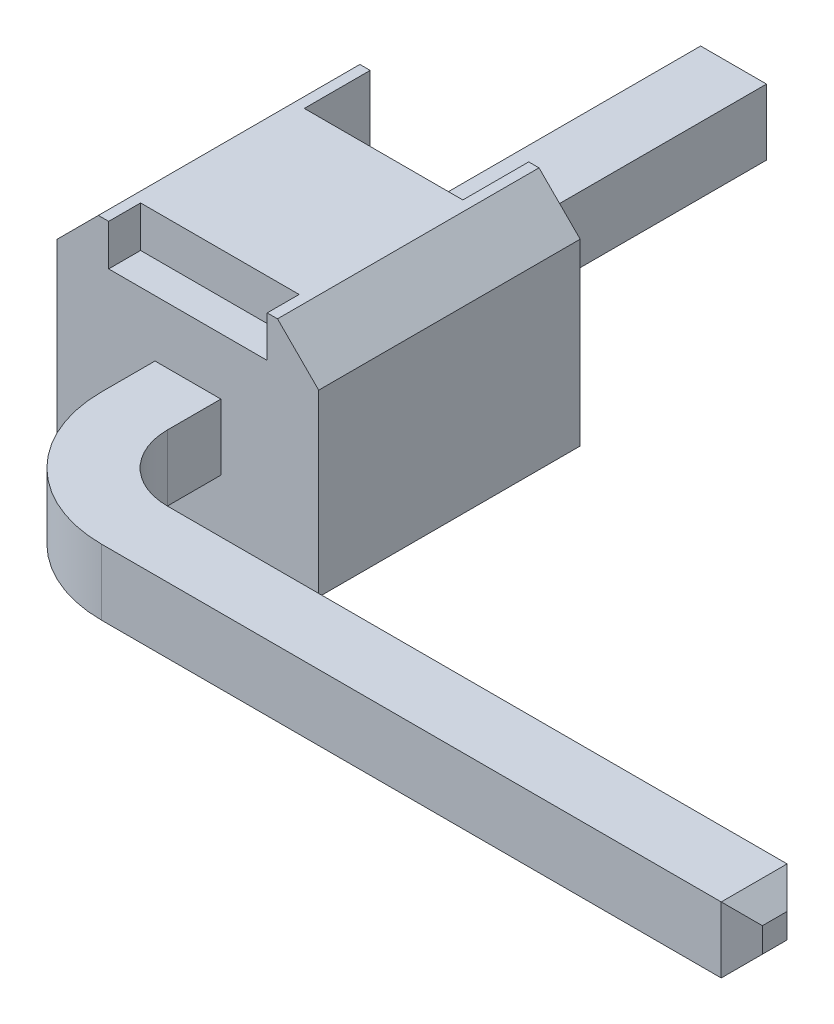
ISO-10303-21;
HEADER;
FILE_DESCRIPTION(('STEP AP214'),'2;1');
FILE_NAME('part.step','',(''),(''),'','','');
FILE_SCHEMA(('AUTOMOTIVE_DESIGN { 1 0 10303 214 1 1 1 1 }'));
ENDSEC;
DATA;
#1=APPLICATION_CONTEXT('core data for automotive mechanical design processes');
#2=APPLICATION_PROTOCOL_DEFINITION('international standard','automotive_design',2000,#1);
#3=PRODUCT_CONTEXT('',#1,'mechanical');
#4=PRODUCT('Part','Part','',(#3));
#5=PRODUCT_RELATED_PRODUCT_CATEGORY('part','',(#4));
#6=PRODUCT_DEFINITION_FORMATION('','',#4);
#7=PRODUCT_DEFINITION_CONTEXT('part definition',#1,'design');
#8=PRODUCT_DEFINITION('design','',#6,#7);
#9=PRODUCT_DEFINITION_SHAPE('','',#8);
#10=(LENGTH_UNIT() NAMED_UNIT(*) SI_UNIT(.MILLI.,.METRE.));
#11=(NAMED_UNIT(*) PLANE_ANGLE_UNIT() SI_UNIT($,.RADIAN.));
#12=(NAMED_UNIT(*) SI_UNIT($,.STERADIAN.) SOLID_ANGLE_UNIT());
#13=UNCERTAINTY_MEASURE_WITH_UNIT(LENGTH_MEASURE(1.E-05),#10,'distance_accuracy_value','');
#14=(GEOMETRIC_REPRESENTATION_CONTEXT(3) GLOBAL_UNCERTAINTY_ASSIGNED_CONTEXT((#13)) GLOBAL_UNIT_ASSIGNED_CONTEXT((#10,
#11,#12)) REPRESENTATION_CONTEXT('',''));
#15=CARTESIAN_POINT('',(0.,0.,0.));
#16=DIRECTION('',(0.,0.,1.));
#17=DIRECTION('',(1.,0.,0.));
#18=AXIS2_PLACEMENT_3D('',#15,#16,#17);
#19=CARTESIAN_POINT('',(7.08,0.22,7.1));
#20=DIRECTION('',(0.707106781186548,0.707106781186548,0.));
#21=DIRECTION('',(-0.707106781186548,0.707106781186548,0.));
#22=AXIS2_PLACEMENT_3D('',#19,#20,#21);
#23=PLANE('',#22);
#24=DIRECTION('',(0.577350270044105,-0.577350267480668,0.577350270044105));
#25=VECTOR('',#24,1.);
#26=CARTESIAN_POINT('',(6.97999999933,0.32,6.65999999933));
#27=LINE('',#26,#25);
#28=CARTESIAN_POINT('',(6.97999999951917,0.319999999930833,6.65999999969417));
#29=VERTEX_POINT('',#28);
#30=CARTESIAN_POINT('',(7.17999999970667,0.120000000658,6.85999999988));
#31=VERTEX_POINT('',#30);
#32=EDGE_CURVE('P0_E184',#29,#31,#27,.T.);
#33=ORIENTED_EDGE('',*,*,#32,.F.);
#34=DIRECTION('',(0.,0.,1.));
#35=VECTOR('',#34,1.);
#36=CARTESIAN_POINT('',(6.97999999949,0.32,5.1935));
#37=LINE('',#36,#35);
#38=CARTESIAN_POINT('',(6.98000000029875,0.319999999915,7.29999999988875));
#39=VERTEX_POINT('',#38);
#40=EDGE_CURVE('P0_E174',#39,#29,#37,.F.);
#41=ORIENTED_EDGE('',*,*,#40,.F.);
#42=DIRECTION('',(-0.577350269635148,0.577350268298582,0.577350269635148));
#43=VECTOR('',#42,1.);
#44=CARTESIAN_POINT('',(7.17999999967,0.120000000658,7.10000000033));
#45=LINE('',#44,#43);
#46=CARTESIAN_POINT('',(7.17999999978,0.120000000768,7.10000000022));
#47=VERTEX_POINT('',#46);
#48=EDGE_CURVE('P0_E206',#47,#39,#45,.T.);
#49=ORIENTED_EDGE('',*,*,#48,.F.);
#50=DIRECTION('',(0.,0.,-1.));
#51=VECTOR('',#50,1.);
#52=CARTESIAN_POINT('',(7.18,0.120000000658,7.3));
#53=LINE('',#52,#51);
#54=EDGE_CURVE('P0_E203',#31,#47,#53,.F.);
#55=ORIENTED_EDGE('',*,*,#54,.F.);
#56=EDGE_LOOP('',(#33,#41,#49,#55));
#57=FACE_BOUND('',#56,.T.);
#58=ADVANCED_FACE('P0_F17',(#57),#23,.T.);
#59=CARTESIAN_POINT('',(0.12,0.22,0.1));
#60=DIRECTION('',(0.,0.707106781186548,-0.707106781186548));
#61=DIRECTION('',(0.,0.707106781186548,0.707106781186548));
#62=AXIS2_PLACEMENT_3D('',#59,#60,#61);
#63=PLANE('',#62);
#64=DIRECTION('',(0.577350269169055,-0.577350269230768,-0.577350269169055));
#65=VECTOR('',#64,1.);
#66=CARTESIAN_POINT('',(-0.3199999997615,0.32,0.1999999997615));
#67=LINE('',#66,#65);
#68=CARTESIAN_POINT('',(-0.319999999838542,0.320000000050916,0.200000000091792));
#69=VERTEX_POINT('',#68);
#70=CARTESIAN_POINT('',(-0.120000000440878,0.120000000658,2.93918683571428E-10));
#71=VERTEX_POINT('',#70);
#72=EDGE_CURVE('P0_E150',#69,#71,#67,.T.);
#73=ORIENTED_EDGE('',*,*,#72,.F.);
#74=DIRECTION('',(1.,0.,0.));
#75=VECTOR('',#74,1.);
#76=CARTESIAN_POINT('',(1.8865,0.319999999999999,0.200000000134));
#77=LINE('',#76,#75);
#78=CARTESIAN_POINT('',(0.31999999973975,0.319999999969,0.19999999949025));
#79=VERTEX_POINT('',#78);
#80=EDGE_CURVE('P0_E164',#79,#69,#77,.F.);
#81=ORIENTED_EDGE('',*,*,#80,.F.);
#82=DIRECTION('',(0.577350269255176,0.577350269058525,0.577350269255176));
#83=VECTOR('',#82,1.);
#84=CARTESIAN_POINT('',(0.120000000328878,0.120000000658,3.28877979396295E-10));
#85=LINE('',#84,#83);
#86=CARTESIAN_POINT('',(0.120000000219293,0.120000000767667,2.19292688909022E-10));
#87=VERTEX_POINT('',#86);
#88=EDGE_CURVE('P0_E160',#87,#79,#85,.T.);
#89=ORIENTED_EDGE('',*,*,#88,.F.);
#90=DIRECTION('',(1.,0.,0.));
#91=VECTOR('',#90,1.);
#92=CARTESIAN_POINT('',(0.32,0.120000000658,0.));
#93=LINE('',#92,#91);
#94=EDGE_CURVE('P0_E159',#71,#87,#93,.T.);
#95=ORIENTED_EDGE('',*,*,#94,.F.);
#96=EDGE_LOOP('',(#73,#81,#89,#95));
#97=FACE_BOUND('',#96,.T.);
#98=ADVANCED_FACE('P0_F337',(#97),#63,.T.);
#99=CARTESIAN_POINT('',(7.08,0.32,7.2));
#100=DIRECTION('',(0.707106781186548,0.,0.707106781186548));
#101=DIRECTION('',(0.707106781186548,0.,-0.707106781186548));
#102=AXIS2_PLACEMENT_3D('',#99,#100,#101);
#103=PLANE('',#102);
#104=DIRECTION('',(0.,-1.,0.));
#105=VECTOR('',#104,1.);
#106=CARTESIAN_POINT('',(6.98000000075,0.32,7.3));
#107=LINE('',#106,#105);
#108=CARTESIAN_POINT('',(6.98000000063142,-0.320000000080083,7.29999999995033));
#109=VERTEX_POINT('',#108);
#110=EDGE_CURVE('P0_E111',#109,#39,#107,.F.);
#111=ORIENTED_EDGE('',*,*,#110,.F.);
#112=DIRECTION('',(0.577350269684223,0.577350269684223,-0.577350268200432));
#113=VECTOR('',#112,1.);
#114=CARTESIAN_POINT('',(6.980000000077,-0.319999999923,7.3));
#115=LINE('',#114,#113);
#116=CARTESIAN_POINT('',(7.179999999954,-0.120000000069,7.10000000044));
#117=VERTEX_POINT('',#116);
#118=EDGE_CURVE('P0_E128',#109,#117,#115,.T.);
#119=ORIENTED_EDGE('',*,*,#118,.T.);
#120=DIRECTION('',(0.,1.,0.));
#121=VECTOR('',#120,1.);
#122=CARTESIAN_POINT('',(7.18,0.32,7.1));
#123=LINE('',#122,#121);
#124=EDGE_CURVE('P0_E194',#47,#117,#123,.F.);
#125=ORIENTED_EDGE('',*,*,#124,.F.);
#126=ORIENTED_EDGE('',*,*,#48,.T.);
#127=EDGE_LOOP('',(#111,#119,#125,#126));
#128=FACE_BOUND('',#127,.T.);
#129=ADVANCED_FACE('P0_F256',(#128),#103,.T.);
#130=CARTESIAN_POINT('',(7.18,0.32,7.3));
#131=DIRECTION('',(1.,0.,0.));
#132=DIRECTION('',(0.,0.,-1.));
#133=AXIS2_PLACEMENT_3D('',#130,#131,#132);
#134=PLANE('',#133);
#135=ORIENTED_EDGE('',*,*,#124,.T.);
#136=DIRECTION('',(0.,0.,1.));
#137=VECTOR('',#136,1.);
#138=CARTESIAN_POINT('',(7.179999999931,-0.120000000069,7.1));
#139=LINE('',#138,#137);
#140=CARTESIAN_POINT('',(7.17999999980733,-0.120000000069,6.85999999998));
#141=VERTEX_POINT('',#140);
#142=EDGE_CURVE('P0_E197',#117,#141,#139,.F.);
#143=ORIENTED_EDGE('',*,*,#142,.T.);
#144=DIRECTION('',(0.,1.,0.));
#145=VECTOR('',#144,1.);
#146=CARTESIAN_POINT('',(7.17999999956,0.32,6.85999999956));
#147=LINE('',#146,#145);
#148=EDGE_CURVE('P0_E187',#31,#141,#147,.F.);
#149=ORIENTED_EDGE('',*,*,#148,.F.);
#150=ORIENTED_EDGE('',*,*,#54,.T.);
#151=EDGE_LOOP('',(#135,#143,#149,#150));
#152=FACE_BOUND('',#151,.T.);
#153=ADVANCED_FACE('P0_F264',(#152),#134,.T.);
#154=CARTESIAN_POINT('',(7.08,0.32,6.76));
#155=DIRECTION('',(0.707106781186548,0.,-0.707106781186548));
#156=DIRECTION('',(-0.707106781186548,0.,-0.707106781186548));
#157=AXIS2_PLACEMENT_3D('',#154,#155,#156);
#158=PLANE('',#157);
#159=DIRECTION('',(0.,1.,0.));
#160=VECTOR('',#159,1.);
#161=CARTESIAN_POINT('',(6.97999999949,0.32,6.66));
#162=LINE('',#161,#160);
#163=CARTESIAN_POINT('',(6.98000000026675,-0.31999999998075,6.66));
#164=VERTEX_POINT('',#163);
#165=EDGE_CURVE('P0_E180',#29,#164,#162,.F.);
#166=ORIENTED_EDGE('',*,*,#165,.F.);
#167=ORIENTED_EDGE('',*,*,#32,.T.);
#168=ORIENTED_EDGE('',*,*,#148,.T.);
#169=DIRECTION('',(-0.577350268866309,-0.577350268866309,-0.577350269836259));
#170=VECTOR('',#169,1.);
#171=CARTESIAN_POINT('',(7.180000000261,-0.119999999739,6.86000000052));
#172=LINE('',#171,#170);
#173=EDGE_CURVE('P0_E181',#141,#164,#172,.T.);
#174=ORIENTED_EDGE('',*,*,#173,.T.);
#175=EDGE_LOOP('',(#166,#167,#168,#174));
#176=FACE_BOUND('',#175,.T.);
#177=ADVANCED_FACE('P0_F273',(#176),#158,.T.);
#178=CARTESIAN_POINT('',(1.8865,0.32,5.1935));
#179=DIRECTION('',(0.,1.,0.));
#180=DIRECTION('',(0.,0.,1.));
#181=AXIS2_PLACEMENT_3D('',#178,#179,#180);
#182=PLANE('',#181);
#183=DIRECTION('',(0.,0.,-1.));
#184=VECTOR('',#183,1.);
#185=CARTESIAN_POINT('',(0.32,0.32,6.66));
#186=LINE('',#185,#184);
#187=CARTESIAN_POINT('',(0.32,0.32,6.020000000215));
#188=VERTEX_POINT('',#187);
#189=EDGE_CURVE('P0_E167',#79,#188,#186,.F.);
#190=ORIENTED_EDGE('',*,*,#189,.F.);
#191=ORIENTED_EDGE('',*,*,#80,.T.);
#192=DIRECTION('',(0.,0.,1.));
#193=VECTOR('',#192,1.);
#194=CARTESIAN_POINT('',(-0.32,0.32,0.));
#195=LINE('',#194,#193);
#196=CARTESIAN_POINT('',(-0.32,0.32,6.020000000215));
#197=VERTEX_POINT('',#196);
#198=EDGE_CURVE('P0_E119',#197,#69,#195,.F.);
#199=ORIENTED_EDGE('',*,*,#198,.F.);
#200=CARTESIAN_POINT('',(0.96,0.32,6.02));
#201=DIRECTION('',(0.,-1.,0.));
#202=DIRECTION('',(0.,0.,-1.));
#203=AXIS2_PLACEMENT_3D('',#200,#201,#202);
#204=CIRCLE('',#203,1.28);
#205=CARTESIAN_POINT('',(0.95999999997,0.32,7.3));
#206=VERTEX_POINT('',#205);
#207=EDGE_CURVE('P0_E20',#206,#197,#204,.T.);
#208=ORIENTED_EDGE('',*,*,#207,.F.);
#209=DIRECTION('',(1.,0.,0.));
#210=VECTOR('',#209,1.);
#211=CARTESIAN_POINT('',(-0.32,0.32,7.3));
#212=LINE('',#211,#210);
#213=EDGE_CURVE('P0_E103',#39,#206,#212,.F.);
#214=ORIENTED_EDGE('',*,*,#213,.F.);
#215=ORIENTED_EDGE('',*,*,#40,.T.);
#216=DIRECTION('',(1.,0.,0.));
#217=VECTOR('',#216,1.);
#218=CARTESIAN_POINT('',(7.18,0.32,6.66));
#219=LINE('',#218,#217);
#220=CARTESIAN_POINT('',(0.96,0.32,6.66));
#221=VERTEX_POINT('',#220);
#222=EDGE_CURVE('P0_E177',#221,#29,#219,.T.);
#223=ORIENTED_EDGE('',*,*,#222,.F.);
#224=CARTESIAN_POINT('',(0.96,0.32,6.02));
#225=DIRECTION('',(0.,-1.,0.));
#226=DIRECTION('',(0.,0.,-1.));
#227=AXIS2_PLACEMENT_3D('',#224,#225,#226);
#228=CIRCLE('',#227,0.64);
#229=EDGE_CURVE('P0_E170',#221,#188,#228,.T.);
#230=ORIENTED_EDGE('',*,*,#229,.T.);
#231=EDGE_LOOP('',(#190,#191,#199,#208,#214,#215,#223,#230));
#232=FACE_BOUND('',#231,.T.);
#233=ADVANCED_FACE('P0_F117',(#232),#182,.T.);
#234=CARTESIAN_POINT('',(0.22,0.32,0.1));
#235=DIRECTION('',(0.707106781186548,0.,-0.707106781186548));
#236=DIRECTION('',(-0.707106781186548,0.,-0.707106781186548));
#237=AXIS2_PLACEMENT_3D('',#234,#235,#236);
#238=PLANE('',#237);
#239=DIRECTION('',(-0.577350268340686,0.577350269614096,-0.577350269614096));
#240=VECTOR('',#239,1.);
#241=CARTESIAN_POINT('',(0.32,-0.319999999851,0.199999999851));
#242=LINE('',#241,#240);
#243=CARTESIAN_POINT('',(0.319999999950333,-0.319999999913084,0.199999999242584));
#244=VERTEX_POINT('',#243);
#245=CARTESIAN_POINT('',(0.120000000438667,-0.120000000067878,4.52520514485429E-11));
#246=VERTEX_POINT('',#245);
#247=EDGE_CURVE('P0_E34',#244,#246,#242,.T.);
#248=ORIENTED_EDGE('',*,*,#247,.T.);
#249=DIRECTION('',(0.,1.,0.));
#250=VECTOR('',#249,1.);
#251=CARTESIAN_POINT('',(0.12,0.32,0.));
#252=LINE('',#251,#250);
#253=EDGE_CURVE('P0_E157',#87,#246,#252,.F.);
#254=ORIENTED_EDGE('',*,*,#253,.F.);
#255=ORIENTED_EDGE('',*,*,#88,.T.);
#256=DIRECTION('',(0.,1.,0.));
#257=VECTOR('',#256,1.);
#258=CARTESIAN_POINT('',(0.32,0.32,0.199999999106));
#259=LINE('',#258,#257);
#260=EDGE_CURVE('P0_E293',#244,#79,#259,.T.);
#261=ORIENTED_EDGE('',*,*,#260,.F.);
#262=EDGE_LOOP('',(#248,#254,#255,#261));
#263=FACE_BOUND('',#262,.T.);
#264=ADVANCED_FACE('P0_F301',(#263),#238,.T.);
#265=CARTESIAN_POINT('',(0.32,0.32,0.));
#266=DIRECTION('',(0.,0.,-1.));
#267=DIRECTION('',(0.,1.,0.));
#268=AXIS2_PLACEMENT_3D('',#265,#266,#267);
#269=PLANE('',#268);
#270=DIRECTION('',(0.,1.,0.));
#271=VECTOR('',#270,1.);
#272=CARTESIAN_POINT('',(-0.120000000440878,0.32,4.40877938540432E-10));
#273=LINE('',#272,#271);
#274=CARTESIAN_POINT('',(-0.120000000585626,-0.120000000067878,1.92211324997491E-10));
#275=VERTEX_POINT('',#274);
#276=EDGE_CURVE('P0_E148',#71,#275,#273,.F.);
#277=ORIENTED_EDGE('',*,*,#276,.F.);
#278=ORIENTED_EDGE('',*,*,#94,.T.);
#279=ORIENTED_EDGE('',*,*,#253,.T.);
#280=DIRECTION('',(1.,0.,0.));
#281=VECTOR('',#280,1.);
#282=CARTESIAN_POINT('',(0.12,-0.120000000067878,6.78779813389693E-11));
#283=LINE('',#282,#281);
#284=EDGE_CURVE('P0_E145',#246,#275,#283,.F.);
#285=ORIENTED_EDGE('',*,*,#284,.T.);
#286=EDGE_LOOP('',(#277,#278,#279,#285));
#287=FACE_BOUND('',#286,.T.);
#288=ADVANCED_FACE('P0_F333',(#287),#269,.T.);
#289=CARTESIAN_POINT('',(-0.22,0.32,0.1));
#290=DIRECTION('',(-0.707106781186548,0.,-0.707106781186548));
#291=DIRECTION('',(-0.707106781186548,0.,0.707106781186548));
#292=AXIS2_PLACEMENT_3D('',#289,#290,#291);
#293=PLANE('',#292);
#294=ORIENTED_EDGE('',*,*,#72,.T.);
#295=ORIENTED_EDGE('',*,*,#276,.T.);
#296=DIRECTION('',(-0.577350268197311,-0.577350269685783,0.577350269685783));
#297=VECTOR('',#296,1.);
#298=CARTESIAN_POINT('',(-0.120000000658,-0.120000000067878,6.78779813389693E-11));
#299=LINE('',#298,#297);
#300=CARTESIAN_POINT('',(-0.319999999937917,-0.319999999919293,0.199999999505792));
#301=VERTEX_POINT('',#300);
#302=EDGE_CURVE('P0_E141',#275,#301,#299,.T.);
#303=ORIENTED_EDGE('',*,*,#302,.T.);
#304=DIRECTION('',(0.,1.,0.));
#305=VECTOR('',#304,1.);
#306=CARTESIAN_POINT('',(-0.32,0.32,0.200000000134));
#307=LINE('',#306,#305);
#308=EDGE_CURVE('P0_E137',#69,#301,#307,.F.);
#309=ORIENTED_EDGE('',*,*,#308,.F.);
#310=EDGE_LOOP('',(#294,#295,#303,#309));
#311=FACE_BOUND('',#310,.T.);
#312=ADVANCED_FACE('P0_F340',(#311),#293,.T.);
#313=CARTESIAN_POINT('',(-0.32,0.32,0.));
#314=DIRECTION('',(-1.,0.,0.));
#315=DIRECTION('',(0.,0.,1.));
#316=AXIS2_PLACEMENT_3D('',#313,#314,#315);
#317=PLANE('',#316);
#318=DIRECTION('',(0.,0.,1.));
#319=VECTOR('',#318,1.);
#320=CARTESIAN_POINT('',(-0.32,-0.32,5.1935));
#321=LINE('',#320,#319);
#322=CARTESIAN_POINT('',(-0.32,-0.320000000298,6.020000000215));
#323=VERTEX_POINT('',#322);
#324=EDGE_CURVE('P0_E144',#301,#323,#321,.T.);
#325=ORIENTED_EDGE('',*,*,#324,.T.);
#326=DIRECTION('',(0.,-1.,0.));
#327=VECTOR('',#326,1.);
#328=CARTESIAN_POINT('',(-0.32,0.32,6.02000000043));
#329=LINE('',#328,#327);
#330=EDGE_CURVE('P0_E122',#197,#323,#329,.T.);
#331=ORIENTED_EDGE('',*,*,#330,.F.);
#332=ORIENTED_EDGE('',*,*,#198,.T.);
#333=ORIENTED_EDGE('',*,*,#308,.T.);
#334=EDGE_LOOP('',(#325,#331,#332,#333));
#335=FACE_BOUND('',#334,.T.);
#336=ADVANCED_FACE('P0_F339',(#335),#317,.T.);
#337=CARTESIAN_POINT('',(0.96,0.32,6.02));
#338=DIRECTION('',(0.,-1.,0.));
#339=DIRECTION('',(0.,0.,-1.));
#340=AXIS2_PLACEMENT_3D('',#337,#338,#339);
#341=CYLINDRICAL_SURFACE('',#340,1.28);
#342=DIRECTION('',(0.,-1.,0.));
#343=VECTOR('',#342,1.);
#344=CARTESIAN_POINT('',(0.95999999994,0.32,7.3));
#345=LINE('',#344,#343);
#346=CARTESIAN_POINT('',(0.95999999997,-0.320000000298,7.3));
#347=VERTEX_POINT('',#346);
#348=EDGE_CURVE('P0_E108',#206,#347,#345,.T.);
#349=ORIENTED_EDGE('',*,*,#348,.F.);
#350=ORIENTED_EDGE('',*,*,#207,.T.);
#351=ORIENTED_EDGE('',*,*,#330,.T.);
#352=CARTESIAN_POINT('',(0.96,-0.320000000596,6.02));
#353=DIRECTION('',(0.,-1.,0.));
#354=DIRECTION('',(0.,0.,-1.));
#355=AXIS2_PLACEMENT_3D('',#352,#353,#354);
#356=CIRCLE('',#355,1.28);
#357=EDGE_CURVE('P0_E126',#323,#347,#356,.F.);
#358=ORIENTED_EDGE('',*,*,#357,.T.);
#359=EDGE_LOOP('',(#349,#350,#351,#358));
#360=FACE_BOUND('',#359,.T.);
#361=ADVANCED_FACE('P0_F124',(#360),#341,.T.);
#362=CARTESIAN_POINT('',(-0.32,0.32,7.3));
#363=DIRECTION('',(0.,0.,1.));
#364=DIRECTION('',(0.,-1.,0.));
#365=AXIS2_PLACEMENT_3D('',#362,#363,#364);
#366=PLANE('',#365);
#367=DIRECTION('',(1.,0.,0.));
#368=VECTOR('',#367,1.);
#369=CARTESIAN_POINT('',(1.8865,-0.32,7.3));
#370=LINE('',#369,#368);
#371=EDGE_CURVE('P0_E229',#347,#109,#370,.T.);
#372=ORIENTED_EDGE('',*,*,#371,.T.);
#373=ORIENTED_EDGE('',*,*,#110,.T.);
#374=ORIENTED_EDGE('',*,*,#213,.T.);
#375=ORIENTED_EDGE('',*,*,#348,.T.);
#376=EDGE_LOOP('',(#372,#373,#374,#375));
#377=FACE_BOUND('',#376,.T.);
#378=ADVANCED_FACE('P0_F106',(#377),#366,.T.);
#379=CARTESIAN_POINT('',(7.08,-0.22,7.1));
#380=DIRECTION('',(-0.707106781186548,0.707106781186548,0.));
#381=DIRECTION('',(-0.707106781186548,-0.707106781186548,0.));
#382=AXIS2_PLACEMENT_3D('',#379,#380,#381);
#383=PLANE('',#382);
#384=ORIENTED_EDGE('',*,*,#173,.F.);
#385=ORIENTED_EDGE('',*,*,#142,.F.);
#386=ORIENTED_EDGE('',*,*,#118,.F.);
#387=DIRECTION('',(0.,0.,1.));
#388=VECTOR('',#387,1.);
#389=CARTESIAN_POINT('',(6.98000000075,-0.32,5.1935));
#390=LINE('',#389,#388);
#391=EDGE_CURVE('P0_E245',#109,#164,#390,.F.);
#392=ORIENTED_EDGE('',*,*,#391,.T.);
#393=EDGE_LOOP('',(#384,#385,#386,#392));
#394=FACE_BOUND('',#393,.T.);
#395=ADVANCED_FACE('P0_F261',(#394),#383,.F.);
#396=CARTESIAN_POINT('',(7.18,0.32,6.66));
#397=DIRECTION('',(0.,0.,-1.));
#398=DIRECTION('',(0.,1.,0.));
#399=AXIS2_PLACEMENT_3D('',#396,#397,#398);
#400=PLANE('',#399);
#401=DIRECTION('',(1.,0.,0.));
#402=VECTOR('',#401,1.);
#403=CARTESIAN_POINT('',(1.8865,-0.32,6.66));
#404=LINE('',#403,#402);
#405=CARTESIAN_POINT('',(0.96,-0.320000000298,6.66));
#406=VERTEX_POINT('',#405);
#407=EDGE_CURVE('P0_E228',#164,#406,#404,.F.);
#408=ORIENTED_EDGE('',*,*,#407,.T.);
#409=DIRECTION('',(0.,-1.,0.));
#410=VECTOR('',#409,1.);
#411=CARTESIAN_POINT('',(0.96,0.32,6.66));
#412=LINE('',#411,#410);
#413=EDGE_CURVE('P0_E231',#406,#221,#412,.F.);
#414=ORIENTED_EDGE('',*,*,#413,.T.);
#415=ORIENTED_EDGE('',*,*,#222,.T.);
#416=ORIENTED_EDGE('',*,*,#165,.T.);
#417=EDGE_LOOP('',(#408,#414,#415,#416));
#418=FACE_BOUND('',#417,.T.);
#419=ADVANCED_FACE('P0_F270',(#418),#400,.T.);
#420=CARTESIAN_POINT('',(0.96,0.32,6.02));
#421=DIRECTION('',(0.,-1.,0.));
#422=DIRECTION('',(0.,0.,-1.));
#423=AXIS2_PLACEMENT_3D('',#420,#421,#422);
#424=CYLINDRICAL_SURFACE('',#423,0.64);
#425=ORIENTED_EDGE('',*,*,#413,.F.);
#426=CARTESIAN_POINT('',(0.96,-0.320000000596,6.02));
#427=DIRECTION('',(0.,-1.,0.));
#428=DIRECTION('',(0.,0.,-1.));
#429=AXIS2_PLACEMENT_3D('',#426,#427,#428);
#430=CIRCLE('',#429,0.64);
#431=CARTESIAN_POINT('',(0.32,-0.320000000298,6.020000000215));
#432=VERTEX_POINT('',#431);
#433=EDGE_CURVE('P0_E225',#406,#432,#430,.T.);
#434=ORIENTED_EDGE('',*,*,#433,.T.);
#435=DIRECTION('',(0.,1.,0.));
#436=VECTOR('',#435,1.);
#437=CARTESIAN_POINT('',(0.32,0.32,6.02000000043));
#438=LINE('',#437,#436);
#439=EDGE_CURVE('P0_E169',#188,#432,#438,.F.);
#440=ORIENTED_EDGE('',*,*,#439,.F.);
#441=ORIENTED_EDGE('',*,*,#229,.F.);
#442=EDGE_LOOP('',(#425,#434,#440,#441));
#443=FACE_BOUND('',#442,.T.);
#444=ADVANCED_FACE('P0_F310',(#443),#424,.F.);
#445=CARTESIAN_POINT('',(0.32,0.32,6.66));
#446=DIRECTION('',(1.,0.,0.));
#447=DIRECTION('',(0.,0.,-1.));
#448=AXIS2_PLACEMENT_3D('',#445,#446,#447);
#449=PLANE('',#448);
#450=DIRECTION('',(0.,0.,1.));
#451=VECTOR('',#450,1.);
#452=CARTESIAN_POINT('',(0.32,-0.32,5.1935));
#453=LINE('',#452,#451);
#454=EDGE_CURVE('P0_E26',#432,#244,#453,.F.);
#455=ORIENTED_EDGE('',*,*,#454,.T.);
#456=ORIENTED_EDGE('',*,*,#260,.T.);
#457=ORIENTED_EDGE('',*,*,#189,.T.);
#458=ORIENTED_EDGE('',*,*,#439,.T.);
#459=EDGE_LOOP('',(#455,#456,#457,#458));
#460=FACE_BOUND('',#459,.T.);
#461=ADVANCED_FACE('P0_F308',(#460),#449,.T.);
#462=CARTESIAN_POINT('',(0.12,-0.22,0.1));
#463=DIRECTION('',(0.,0.707106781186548,0.707106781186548));
#464=DIRECTION('',(0.,-0.707106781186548,0.707106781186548));
#465=AXIS2_PLACEMENT_3D('',#462,#463,#464);
#466=PLANE('',#465);
#467=ORIENTED_EDGE('',*,*,#302,.F.);
#468=ORIENTED_EDGE('',*,*,#284,.F.);
#469=ORIENTED_EDGE('',*,*,#247,.F.);
#470=DIRECTION('',(1.,0.,0.));
#471=VECTOR('',#470,1.);
#472=CARTESIAN_POINT('',(1.8865,-0.320000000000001,0.199999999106));
#473=LINE('',#472,#471);
#474=EDGE_CURVE('P0_E11',#244,#301,#473,.F.);
#475=ORIENTED_EDGE('',*,*,#474,.T.);
#476=EDGE_LOOP('',(#467,#468,#469,#475));
#477=FACE_BOUND('',#476,.T.);
#478=ADVANCED_FACE('P0_F318',(#477),#466,.F.);
#479=CARTESIAN_POINT('',(1.8865,-0.32,5.1935));
#480=DIRECTION('',(0.,1.,0.));
#481=DIRECTION('',(0.,0.,1.));
#482=AXIS2_PLACEMENT_3D('',#479,#480,#481);
#483=PLANE('',#482);
#484=ORIENTED_EDGE('',*,*,#454,.F.);
#485=ORIENTED_EDGE('',*,*,#433,.F.);
#486=ORIENTED_EDGE('',*,*,#407,.F.);
#487=ORIENTED_EDGE('',*,*,#391,.F.);
#488=ORIENTED_EDGE('',*,*,#371,.F.);
#489=ORIENTED_EDGE('',*,*,#357,.F.);
#490=ORIENTED_EDGE('',*,*,#324,.F.);
#491=ORIENTED_EDGE('',*,*,#474,.F.);
#492=EDGE_LOOP('',(#484,#485,#486,#487,#488,#489,#490,#491));
#493=FACE_BOUND('',#492,.T.);
#494=ADVANCED_FACE('P0_F277',(#493),#483,.F.);
#495=CLOSED_SHELL('',(#58,#98,#129,#153,#177,#233,#264,#288,#312,#336,#361,#378,#395,#419,#444,
#461,#478,#494));
#496=MANIFOLD_SOLID_BREP('P0_B1',#495);
#497=CARTESIAN_POINT('',(0.,1.27,4.20986013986));
#498=DIRECTION('',(0.,1.,0.));
#499=DIRECTION('',(0.,0.,1.));
#500=AXIS2_PLACEMENT_3D('',#497,#498,#499);
#501=PLANE('',#500);
#502=DIRECTION('',(1.,0.,0.));
#503=VECTOR('',#502,1.);
#504=CARTESIAN_POINT('',(0.,1.27,3.60000000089));
#505=LINE('',#504,#503);
#506=CARTESIAN_POINT('',(0.76999999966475,1.27,3.6000000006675));
#507=VERTEX_POINT('',#506);
#508=CARTESIAN_POINT('',(-0.76999999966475,1.27,3.6000000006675));
#509=VERTEX_POINT('',#508);
#510=EDGE_CURVE('P1_E210',#507,#509,#505,.F.);
#511=ORIENTED_EDGE('',*,*,#510,.T.);
#512=DIRECTION('',(0.,0.,-1.));
#513=VECTOR('',#512,1.);
#514=CARTESIAN_POINT('',(-0.77,1.27,3.6));
#515=LINE('',#514,#513);
#516=CARTESIAN_POINT('',(-0.76999999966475,1.27,2.960000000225));
#517=VERTEX_POINT('',#516);
#518=EDGE_CURVE('P1_E201',#517,#509,#515,.F.);
#519=ORIENTED_EDGE('',*,*,#518,.F.);
#520=DIRECTION('',(1.,0.,0.));
#521=VECTOR('',#520,1.);
#522=CARTESIAN_POINT('',(-0.77,1.27,2.96));
#523=LINE('',#522,#521);
#524=CARTESIAN_POINT('',(-0.869999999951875,1.27000000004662,2.960000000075));
#525=VERTEX_POINT('',#524);
#526=EDGE_CURVE('P1_E175',#525,#517,#523,.T.);
#527=ORIENTED_EDGE('',*,*,#526,.F.);
#528=DIRECTION('',(0.,0.,1.));
#529=VECTOR('',#528,1.);
#530=CARTESIAN_POINT('',(-0.8699999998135,1.2700000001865,2.96));
#531=LINE('',#530,#529);
#532=CARTESIAN_POINT('',(-0.869999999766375,1.27000000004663,5.5));
#533=VERTEX_POINT('',#532);
#534=EDGE_CURVE('P1_E172',#533,#525,#531,.F.);
#535=ORIENTED_EDGE('',*,*,#534,.F.);
#536=DIRECTION('',(1.,0.,0.));
#537=VECTOR('',#536,1.);
#538=CARTESIAN_POINT('',(0.,1.27,5.5));
#539=LINE('',#538,#537);
#540=CARTESIAN_POINT('',(-0.77,1.27,5.5));
#541=VERTEX_POINT('',#540);
#542=EDGE_CURVE('P1_E20',#533,#541,#539,.T.);
#543=ORIENTED_EDGE('',*,*,#542,.T.);
#544=DIRECTION('',(0.,0.,1.));
#545=VECTOR('',#544,1.);
#546=CARTESIAN_POINT('',(-0.77,1.27,4.20986013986));
#547=LINE('',#546,#545);
#548=CARTESIAN_POINT('',(-0.76999999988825,1.27,5.19000000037));
#549=VERTEX_POINT('',#548);
#550=EDGE_CURVE('P1_E156',#541,#549,#547,.F.);
#551=ORIENTED_EDGE('',*,*,#550,.T.);
#552=DIRECTION('',(1.,0.,0.));
#553=VECTOR('',#552,1.);
#554=CARTESIAN_POINT('',(0.,1.27,5.19000000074));
#555=LINE('',#554,#553);
#556=CARTESIAN_POINT('',(0.769999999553,1.27,5.19000000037));
#557=VERTEX_POINT('',#556);
#558=EDGE_CURVE('P1_E150',#549,#557,#555,.T.);
#559=ORIENTED_EDGE('',*,*,#558,.T.);
#560=DIRECTION('',(0.,0.,1.));
#561=VECTOR('',#560,1.);
#562=CARTESIAN_POINT('',(0.769999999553,1.27,4.20986013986));
#563=LINE('',#562,#561);
#564=CARTESIAN_POINT('',(0.769999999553,1.27,5.5));
#565=VERTEX_POINT('',#564);
#566=EDGE_CURVE('P1_E214',#557,#565,#563,.T.);
#567=ORIENTED_EDGE('',*,*,#566,.T.);
#568=DIRECTION('',(1.,0.,0.));
#569=VECTOR('',#568,1.);
#570=CARTESIAN_POINT('',(0.,1.27,5.5));
#571=LINE('',#570,#569);
#572=CARTESIAN_POINT('',(0.8700000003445,1.2700000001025,5.5));
#573=VERTEX_POINT('',#572);
#574=EDGE_CURVE('P1_E212',#565,#573,#571,.T.);
#575=ORIENTED_EDGE('',*,*,#574,.T.);
#576=DIRECTION('',(0.,0.,1.));
#577=VECTOR('',#576,1.);
#578=CARTESIAN_POINT('',(0.86999999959,1.27000000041,5.5));
#579=LINE('',#578,#577);
#580=CARTESIAN_POINT('',(0.8699999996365,1.2700000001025,2.9600000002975));
#581=VERTEX_POINT('',#580);
#582=EDGE_CURVE('P1_E288',#581,#573,#579,.T.);
#583=ORIENTED_EDGE('',*,*,#582,.F.);
#584=DIRECTION('',(1.,0.,0.));
#585=VECTOR('',#584,1.);
#586=CARTESIAN_POINT('',(1.27,1.27,2.96));
#587=LINE('',#586,#585);
#588=CARTESIAN_POINT('',(0.7699999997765,1.27,2.960000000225));
#589=VERTEX_POINT('',#588);
#590=EDGE_CURVE('P1_E294',#589,#581,#587,.T.);
#591=ORIENTED_EDGE('',*,*,#590,.F.);
#592=DIRECTION('',(0.,0.,1.));
#593=VECTOR('',#592,1.);
#594=CARTESIAN_POINT('',(0.77,1.27,2.96));
#595=LINE('',#594,#593);
#596=EDGE_CURVE('P1_E206',#507,#589,#595,.F.);
#597=ORIENTED_EDGE('',*,*,#596,.F.);
#598=EDGE_LOOP('',(#511,#519,#527,#535,#543,#551,#559,#567,#575,#583,#591,#597));
#599=FACE_BOUND('',#598,.T.);
#600=ADVANCED_FACE('P1_F17',(#599),#501,.T.);
#601=CARTESIAN_POINT('',(0.77,1.27,2.96));
#602=DIRECTION('',(-1.,0.,0.));
#603=DIRECTION('',(0.,0.,1.));
#604=AXIS2_PLACEMENT_3D('',#601,#602,#603);
#605=PLANE('',#604);
#606=DIRECTION('',(0.,1.,0.));
#607=VECTOR('',#606,1.);
#608=CARTESIAN_POINT('',(0.769999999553,1.27,3.6));
#609=LINE('',#608,#607);
#610=CARTESIAN_POINT('',(0.7699999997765,-1.27,3.6000000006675));
#611=VERTEX_POINT('',#610);
#612=EDGE_CURVE('P1_E277',#507,#611,#609,.F.);
#613=ORIENTED_EDGE('',*,*,#612,.F.);
#614=ORIENTED_EDGE('',*,*,#596,.T.);
#615=DIRECTION('',(0.,1.,0.));
#616=VECTOR('',#615,1.);
#617=CARTESIAN_POINT('',(0.769999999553,1.27,2.96));
#618=LINE('',#617,#616);
#619=CARTESIAN_POINT('',(0.7699999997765,-1.27,2.960000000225));
#620=VERTEX_POINT('',#619);
#621=EDGE_CURVE('P1_E296',#620,#589,#618,.T.);
#622=ORIENTED_EDGE('',*,*,#621,.F.);
#623=DIRECTION('',(0.,0.,1.));
#624=VECTOR('',#623,1.);
#625=CARTESIAN_POINT('',(0.77,-1.27,2.96));
#626=LINE('',#625,#624);
#627=EDGE_CURVE('P1_E208',#620,#611,#626,.T.);
#628=ORIENTED_EDGE('',*,*,#627,.T.);
#629=EDGE_LOOP('',(#613,#614,#622,#628));
#630=FACE_BOUND('',#629,.T.);
#631=ADVANCED_FACE('P1_F347',(#630),#605,.T.);
#632=CARTESIAN_POINT('',(-0.77,1.27,3.6));
#633=DIRECTION('',(1.,0.,0.));
#634=DIRECTION('',(0.,0.,-1.));
#635=AXIS2_PLACEMENT_3D('',#632,#633,#634);
#636=PLANE('',#635);
#637=DIRECTION('',(0.,1.,0.));
#638=VECTOR('',#637,1.);
#639=CARTESIAN_POINT('',(-0.769999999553,1.27,2.96));
#640=LINE('',#639,#638);
#641=CARTESIAN_POINT('',(-0.7699999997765,-1.27,2.960000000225));
#642=VERTEX_POINT('',#641);
#643=EDGE_CURVE('P1_E195',#517,#642,#640,.F.);
#644=ORIENTED_EDGE('',*,*,#643,.F.);
#645=ORIENTED_EDGE('',*,*,#518,.T.);
#646=DIRECTION('',(0.,1.,0.));
#647=VECTOR('',#646,1.);
#648=CARTESIAN_POINT('',(-0.769999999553,1.27,3.6));
#649=LINE('',#648,#647);
#650=CARTESIAN_POINT('',(-0.7699999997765,-1.27,3.6000000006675));
#651=VERTEX_POINT('',#650);
#652=EDGE_CURVE('P1_E274',#651,#509,#649,.T.);
#653=ORIENTED_EDGE('',*,*,#652,.F.);
#654=DIRECTION('',(0.,0.,-1.));
#655=VECTOR('',#654,1.);
#656=CARTESIAN_POINT('',(-0.77,-1.27,3.6));
#657=LINE('',#656,#655);
#658=EDGE_CURVE('P1_E204',#651,#642,#657,.T.);
#659=ORIENTED_EDGE('',*,*,#658,.T.);
#660=EDGE_LOOP('',(#644,#645,#653,#659));
#661=FACE_BOUND('',#660,.T.);
#662=ADVANCED_FACE('P1_F354',(#661),#636,.T.);
#663=CARTESIAN_POINT('',(-0.32,-0.32,0.));
#664=DIRECTION('',(1.,0.,0.));
#665=DIRECTION('',(0.,0.,-1.));
#666=AXIS2_PLACEMENT_3D('',#663,#664,#665);
#667=PLANE('',#666);
#668=DIRECTION('',(0.,0.,1.));
#669=VECTOR('',#668,1.);
#670=CARTESIAN_POINT('',(-0.32,0.32,0.));
#671=LINE('',#670,#669);
#672=CARTESIAN_POINT('',(-0.32,0.320000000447,3.599999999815));
#673=VERTEX_POINT('',#672);
#674=CARTESIAN_POINT('',(-0.32000000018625,0.32000000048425,5.5));
#675=VERTEX_POINT('',#674);
#676=EDGE_CURVE('P1_E262',#673,#675,#671,.T.);
#677=ORIENTED_EDGE('',*,*,#676,.T.);
#678=DIRECTION('',(0.,1.,0.));
#679=VECTOR('',#678,1.);
#680=CARTESIAN_POINT('',(-0.32,-0.32,5.5));
#681=LINE('',#680,#679);
#682=CARTESIAN_POINT('',(-0.32000000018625,-0.31999999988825,5.5));
#683=VERTEX_POINT('',#682);
#684=EDGE_CURVE('P1_E199',#675,#683,#681,.F.);
#685=ORIENTED_EDGE('',*,*,#684,.T.);
#686=DIRECTION('',(0.,0.,1.));
#687=VECTOR('',#686,1.);
#688=CARTESIAN_POINT('',(-0.32,-0.32,0.));
#689=LINE('',#688,#687);
#690=CARTESIAN_POINT('',(-0.32,-0.3199999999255,3.5999999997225));
#691=VERTEX_POINT('',#690);
#692=EDGE_CURVE('P1_E282',#691,#683,#689,.T.);
#693=ORIENTED_EDGE('',*,*,#692,.F.);
#694=DIRECTION('',(0.,1.,0.));
#695=VECTOR('',#694,1.);
#696=CARTESIAN_POINT('',(-0.32,1.27,3.6));
#697=LINE('',#696,#695);
#698=EDGE_CURVE('P1_E271',#673,#691,#697,.F.);
#699=ORIENTED_EDGE('',*,*,#698,.F.);
#700=EDGE_LOOP('',(#677,#685,#693,#699));
#701=FACE_BOUND('',#700,.T.);
#702=ADVANCED_FACE('P1_F408',(#701),#667,.T.);
#703=CARTESIAN_POINT('',(-0.77,1.27,2.96));
#704=DIRECTION('',(0.,0.,-1.));
#705=DIRECTION('',(0.,1.,0.));
#706=AXIS2_PLACEMENT_3D('',#703,#704,#705);
#707=PLANE('',#706);
#708=DIRECTION('',(1.,0.,0.));
#709=VECTOR('',#708,1.);
#710=CARTESIAN_POINT('',(-0.77,-1.27,2.96));
#711=LINE('',#710,#709);
#712=CARTESIAN_POINT('',(-0.870000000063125,-1.26999999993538,2.960000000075));
#713=VERTEX_POINT('',#712);
#714=EDGE_CURVE('P1_E190',#642,#713,#711,.F.);
#715=ORIENTED_EDGE('',*,*,#714,.T.);
#716=DIRECTION('',(-0.707106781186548,0.707106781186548,0.));
#717=VECTOR('',#716,1.);
#718=CARTESIAN_POINT('',(-1.07,-1.07,2.96));
#719=LINE('',#718,#717);
#720=CARTESIAN_POINT('',(-1.2699999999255,-0.8700000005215,2.96));
#721=VERTEX_POINT('',#720);
#722=EDGE_CURVE('P1_E304',#713,#721,#719,.T.);
#723=ORIENTED_EDGE('',*,*,#722,.T.);
#724=DIRECTION('',(0.,1.,0.));
#725=VECTOR('',#724,1.);
#726=CARTESIAN_POINT('',(-1.27,1.27,2.96));
#727=LINE('',#726,#725);
#728=CARTESIAN_POINT('',(-1.27000000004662,0.869999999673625,2.96));
#729=VERTEX_POINT('',#728);
#730=EDGE_CURVE('P1_E258',#729,#721,#727,.F.);
#731=ORIENTED_EDGE('',*,*,#730,.F.);
#732=DIRECTION('',(-0.707106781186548,-0.707106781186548,0.));
#733=VECTOR('',#732,1.);
#734=CARTESIAN_POINT('',(-1.07,1.07,2.96));
#735=LINE('',#734,#733);
#736=EDGE_CURVE('P1_E188',#525,#729,#735,.T.);
#737=ORIENTED_EDGE('',*,*,#736,.F.);
#738=ORIENTED_EDGE('',*,*,#526,.T.);
#739=ORIENTED_EDGE('',*,*,#643,.T.);
#740=EDGE_LOOP('',(#715,#723,#731,#737,#738,#739));
#741=FACE_BOUND('',#740,.T.);
#742=ADVANCED_FACE('P1_F356',(#741),#707,.T.);
#743=CARTESIAN_POINT('',(-1.07,1.07,2.96));
#744=DIRECTION('',(-0.707106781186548,0.707106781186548,0.));
#745=DIRECTION('',(-0.707106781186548,-0.707106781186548,0.));
#746=AXIS2_PLACEMENT_3D('',#743,#744,#745);
#747=PLANE('',#746);
#748=DIRECTION('',(-0.707106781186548,-0.707106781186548,0.));
#749=VECTOR('',#748,1.);
#750=CARTESIAN_POINT('',(-1.07,1.07,5.5));
#751=LINE('',#750,#749);
#752=CARTESIAN_POINT('',(-1.27000000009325,0.86999999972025,5.5));
#753=VERTEX_POINT('',#752);
#754=EDGE_CURVE('P1_E180',#753,#533,#751,.F.);
#755=ORIENTED_EDGE('',*,*,#754,.T.);
#756=ORIENTED_EDGE('',*,*,#534,.T.);
#757=ORIENTED_EDGE('',*,*,#736,.T.);
#758=DIRECTION('',(0.,0.,1.));
#759=VECTOR('',#758,1.);
#760=CARTESIAN_POINT('',(-1.27,0.869999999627,2.96));
#761=LINE('',#760,#759);
#762=EDGE_CURVE('P1_E185',#753,#729,#761,.F.);
#763=ORIENTED_EDGE('',*,*,#762,.F.);
#764=EDGE_LOOP('',(#755,#756,#757,#763));
#765=FACE_BOUND('',#764,.T.);
#766=ADVANCED_FACE('P1_F183',(#765),#747,.T.);
#767=CARTESIAN_POINT('',(-1.07,-1.07,2.96));
#768=DIRECTION('',(0.707106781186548,0.707106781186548,0.));
#769=DIRECTION('',(-0.707106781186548,0.707106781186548,0.));
#770=AXIS2_PLACEMENT_3D('',#767,#768,#769);
#771=PLANE('',#770);
#772=DIRECTION('',(0.,0.,1.));
#773=VECTOR('',#772,1.);
#774=CARTESIAN_POINT('',(-0.869999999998,-1.27,4.20986013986));
#775=LINE('',#774,#773);
#776=CARTESIAN_POINT('',(-0.8700000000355,-1.26999999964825,5.5));
#777=VERTEX_POINT('',#776);
#778=EDGE_CURVE('P1_E243',#713,#777,#775,.T.);
#779=ORIENTED_EDGE('',*,*,#778,.T.);
#780=DIRECTION('',(-0.707106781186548,0.707106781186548,0.));
#781=VECTOR('',#780,1.);
#782=CARTESIAN_POINT('',(-1.07,-1.07,5.5));
#783=LINE('',#782,#781);
#784=CARTESIAN_POINT('',(-1.269999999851,-0.870000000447,5.5));
#785=VERTEX_POINT('',#784);
#786=EDGE_CURVE('P1_E179',#785,#777,#783,.F.);
#787=ORIENTED_EDGE('',*,*,#786,.F.);
#788=DIRECTION('',(0.,0.,1.));
#789=VECTOR('',#788,1.);
#790=CARTESIAN_POINT('',(-1.27,-0.870000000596,2.96));
#791=LINE('',#790,#789);
#792=EDGE_CURVE('P1_E255',#721,#785,#791,.T.);
#793=ORIENTED_EDGE('',*,*,#792,.F.);
#794=ORIENTED_EDGE('',*,*,#722,.F.);
#795=EDGE_LOOP('',(#779,#787,#793,#794));
#796=FACE_BOUND('',#795,.T.);
#797=ADVANCED_FACE('P1_F313',(#796),#771,.F.);
#798=CARTESIAN_POINT('',(1.07,-1.07,5.5));
#799=DIRECTION('',(-0.707106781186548,0.707106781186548,0.));
#800=DIRECTION('',(-0.707106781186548,-0.707106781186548,0.));
#801=AXIS2_PLACEMENT_3D('',#798,#799,#800);
#802=PLANE('',#801);
#803=DIRECTION('',(-0.707106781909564,-0.707106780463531,0.));
#804=VECTOR('',#803,1.);
#805=CARTESIAN_POINT('',(1.27,-0.869999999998,2.96));
#806=LINE('',#805,#804);
#807=CARTESIAN_POINT('',(1.2699999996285,-0.87000000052,2.9600000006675));
#808=VERTEX_POINT('',#807);
#809=CARTESIAN_POINT('',(0.869999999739,-1.270000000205,2.96000000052));
#810=VERTEX_POINT('',#809);
#811=EDGE_CURVE('P1_E299',#808,#810,#806,.T.);
#812=ORIENTED_EDGE('',*,*,#811,.F.);
#813=DIRECTION('',(0.,0.,-1.));
#814=VECTOR('',#813,1.);
#815=CARTESIAN_POINT('',(1.27,-0.870000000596,5.5));
#816=LINE('',#815,#814);
#817=CARTESIAN_POINT('',(1.269999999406,-0.8700000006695,5.5));
#818=VERTEX_POINT('',#817);
#819=EDGE_CURVE('P1_E240',#818,#808,#816,.T.);
#820=ORIENTED_EDGE('',*,*,#819,.F.);
#821=DIRECTION('',(-0.707106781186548,-0.707106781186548,0.));
#822=VECTOR('',#821,1.);
#823=CARTESIAN_POINT('',(1.07,-1.07,5.5));
#824=LINE('',#823,#822);
#825=CARTESIAN_POINT('',(0.870000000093,-1.2699999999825,5.5));
#826=VERTEX_POINT('',#825);
#827=EDGE_CURVE('P1_E302',#826,#818,#824,.F.);
#828=ORIENTED_EDGE('',*,*,#827,.F.);
#829=DIRECTION('',(0.,0.,1.));
#830=VECTOR('',#829,1.);
#831=CARTESIAN_POINT('',(0.870000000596,-1.27,4.20986013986));
#832=LINE('',#831,#830);
#833=EDGE_CURVE('P1_E252',#826,#810,#832,.F.);
#834=ORIENTED_EDGE('',*,*,#833,.T.);
#835=EDGE_LOOP('',(#812,#820,#828,#834));
#836=FACE_BOUND('',#835,.T.);
#837=ADVANCED_FACE('P1_F393',(#836),#802,.F.);
#838=CARTESIAN_POINT('',(1.27,1.27,2.96));
#839=DIRECTION('',(0.,0.,-1.));
#840=DIRECTION('',(0.,1.,0.));
#841=AXIS2_PLACEMENT_3D('',#838,#839,#840);
#842=PLANE('',#841);
#843=ORIENTED_EDGE('',*,*,#590,.T.);
#844=DIRECTION('',(-0.707106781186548,0.707106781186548,0.));
#845=VECTOR('',#844,1.);
#846=CARTESIAN_POINT('',(1.07,1.07,2.96000000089));
#847=LINE('',#846,#845);
#848=CARTESIAN_POINT('',(1.26999999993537,0.869999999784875,2.960000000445));
#849=VERTEX_POINT('',#848);
#850=EDGE_CURVE('P1_E291',#849,#581,#847,.T.);
#851=ORIENTED_EDGE('',*,*,#850,.F.);
#852=DIRECTION('',(0.,1.,0.));
#853=VECTOR('',#852,1.);
#854=CARTESIAN_POINT('',(1.27,1.27,2.96000000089));
#855=LINE('',#854,#853);
#856=EDGE_CURVE('P1_E234',#808,#849,#855,.T.);
#857=ORIENTED_EDGE('',*,*,#856,.F.);
#858=ORIENTED_EDGE('',*,*,#811,.T.);
#859=DIRECTION('',(1.,0.,0.));
#860=VECTOR('',#859,1.);
#861=CARTESIAN_POINT('',(0.,-1.27,2.9600000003));
#862=LINE('',#861,#860);
#863=EDGE_CURVE('P1_E249',#810,#620,#862,.F.);
#864=ORIENTED_EDGE('',*,*,#863,.T.);
#865=ORIENTED_EDGE('',*,*,#621,.T.);
#866=EDGE_LOOP('',(#843,#851,#857,#858,#864,#865));
#867=FACE_BOUND('',#866,.T.);
#868=ADVANCED_FACE('P1_F345',(#867),#842,.T.);
#869=CARTESIAN_POINT('',(1.07,1.07,5.5));
#870=DIRECTION('',(0.707106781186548,0.707106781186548,0.));
#871=DIRECTION('',(-0.707106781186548,0.707106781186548,0.));
#872=AXIS2_PLACEMENT_3D('',#869,#870,#871);
#873=PLANE('',#872);
#874=ORIENTED_EDGE('',*,*,#582,.T.);
#875=DIRECTION('',(-0.707106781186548,0.707106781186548,0.));
#876=VECTOR('',#875,1.);
#877=CARTESIAN_POINT('',(1.07,1.07,5.5));
#878=LINE('',#877,#876);
#879=CARTESIAN_POINT('',(1.26999999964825,0.86999999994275,5.5));
#880=VERTEX_POINT('',#879);
#881=EDGE_CURVE('P1_E286',#573,#880,#878,.F.);
#882=ORIENTED_EDGE('',*,*,#881,.T.);
#883=DIRECTION('',(0.,0.,-1.));
#884=VECTOR('',#883,1.);
#885=CARTESIAN_POINT('',(1.27,0.869999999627,5.5));
#886=LINE('',#885,#884);
#887=EDGE_CURVE('P1_E230',#849,#880,#886,.F.);
#888=ORIENTED_EDGE('',*,*,#887,.F.);
#889=ORIENTED_EDGE('',*,*,#850,.T.);
#890=EDGE_LOOP('',(#874,#882,#888,#889));
#891=FACE_BOUND('',#890,.T.);
#892=ADVANCED_FACE('P1_F339',(#891),#873,.T.);
#893=CARTESIAN_POINT('',(-0.77,0.87,5.19));
#894=DIRECTION('',(0.,0.,1.));
#895=DIRECTION('',(1.,0.,0.));
#896=AXIS2_PLACEMENT_3D('',#893,#894,#895);
#897=PLANE('',#896);
#898=DIRECTION('',(0.,1.,0.));
#899=VECTOR('',#898,1.);
#900=CARTESIAN_POINT('',(0.77,0.87,5.19));
#901=LINE('',#900,#899);
#902=CARTESIAN_POINT('',(0.769999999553,0.8699999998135,5.19));
#903=VERTEX_POINT('',#902);
#904=EDGE_CURVE('P1_E222',#903,#557,#901,.T.);
#905=ORIENTED_EDGE('',*,*,#904,.T.);
#906=ORIENTED_EDGE('',*,*,#558,.F.);
#907=DIRECTION('',(0.,1.,0.));
#908=VECTOR('',#907,1.);
#909=CARTESIAN_POINT('',(-0.769999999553,0.87,5.19));
#910=LINE('',#909,#908);
#911=CARTESIAN_POINT('',(-0.7699999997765,0.86999999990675,5.19));
#912=VERTEX_POINT('',#911);
#913=EDGE_CURVE('P1_E161',#549,#912,#910,.F.);
#914=ORIENTED_EDGE('',*,*,#913,.T.);
#915=DIRECTION('',(1.,0.,0.));
#916=VECTOR('',#915,1.);
#917=CARTESIAN_POINT('',(-0.77,0.87,5.19));
#918=LINE('',#917,#916);
#919=EDGE_CURVE('P1_E227',#903,#912,#918,.F.);
#920=ORIENTED_EDGE('',*,*,#919,.F.);
#921=EDGE_LOOP('',(#905,#906,#914,#920));
#922=FACE_BOUND('',#921,.T.);
#923=ADVANCED_FACE('P1_F225',(#922),#897,.T.);
#924=CARTESIAN_POINT('',(-0.32,-0.32,0.));
#925=DIRECTION('',(0.,1.,0.));
#926=DIRECTION('',(0.,0.,1.));
#927=AXIS2_PLACEMENT_3D('',#924,#925,#926);
#928=PLANE('',#927);
#929=ORIENTED_EDGE('',*,*,#692,.T.);
#930=DIRECTION('',(1.,0.,0.));
#931=VECTOR('',#930,1.);
#932=CARTESIAN_POINT('',(-0.32,-0.32,5.5));
#933=LINE('',#932,#931);
#934=CARTESIAN_POINT('',(0.31999999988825,-0.3199999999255,5.5));
#935=VERTEX_POINT('',#934);
#936=EDGE_CURVE('P1_E280',#683,#935,#933,.T.);
#937=ORIENTED_EDGE('',*,*,#936,.T.);
#938=DIRECTION('',(0.,0.,-1.));
#939=VECTOR('',#938,1.);
#940=CARTESIAN_POINT('',(0.32,-0.319999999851,0.));
#941=LINE('',#940,#939);
#942=CARTESIAN_POINT('',(0.3200000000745,-0.31999999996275,3.5999999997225));
#943=VERTEX_POINT('',#942);
#944=EDGE_CURVE('P1_E330',#935,#943,#941,.T.);
#945=ORIENTED_EDGE('',*,*,#944,.T.);
#946=DIRECTION('',(1.,0.,0.));
#947=VECTOR('',#946,1.);
#948=CARTESIAN_POINT('',(0.77,-0.32,3.6));
#949=LINE('',#948,#947);
#950=EDGE_CURVE('P1_E268',#691,#943,#949,.T.);
#951=ORIENTED_EDGE('',*,*,#950,.F.);
#952=EDGE_LOOP('',(#929,#937,#945,#951));
#953=FACE_BOUND('',#952,.T.);
#954=ADVANCED_FACE('P1_F464',(#953),#928,.T.);
#955=CARTESIAN_POINT('',(0.77,1.27,3.6));
#956=DIRECTION('',(0.,0.,-1.));
#957=DIRECTION('',(0.,1.,0.));
#958=AXIS2_PLACEMENT_3D('',#955,#956,#957);
#959=PLANE('',#958);
#960=ORIENTED_EDGE('',*,*,#950,.T.);
#961=DIRECTION('',(0.,1.,0.));
#962=VECTOR('',#961,1.);
#963=CARTESIAN_POINT('',(0.32,-0.32,3.59999999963));
#964=LINE('',#963,#962);
#965=CARTESIAN_POINT('',(0.32000000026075,0.320000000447,3.599999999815));
#966=VERTEX_POINT('',#965);
#967=EDGE_CURVE('P1_E328',#943,#966,#964,.T.);
#968=ORIENTED_EDGE('',*,*,#967,.T.);
#969=DIRECTION('',(1.,0.,0.));
#970=VECTOR('',#969,1.);
#971=CARTESIAN_POINT('',(-0.32,0.32,3.59999999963));
#972=LINE('',#971,#970);
#973=EDGE_CURVE('P1_E265',#966,#673,#972,.F.);
#974=ORIENTED_EDGE('',*,*,#973,.T.);
#975=ORIENTED_EDGE('',*,*,#698,.T.);
#976=EDGE_LOOP('',(#960,#968,#974,#975));
#977=FACE_BOUND('',#976,.T.);
#978=ORIENTED_EDGE('',*,*,#652,.T.);
#979=ORIENTED_EDGE('',*,*,#510,.F.);
#980=ORIENTED_EDGE('',*,*,#612,.T.);
#981=DIRECTION('',(1.,0.,0.));
#982=VECTOR('',#981,1.);
#983=CARTESIAN_POINT('',(0.,-1.27,3.60000000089));
#984=LINE('',#983,#982);
#985=EDGE_CURVE('P1_E246',#611,#651,#984,.F.);
#986=ORIENTED_EDGE('',*,*,#985,.T.);
#987=EDGE_LOOP('',(#978,#979,#980,#986));
#988=FACE_BOUND('',#987,.T.);
#989=ADVANCED_FACE('P1_F350',(#977,#988),#959,.T.);
#990=CARTESIAN_POINT('',(-0.32,0.32,0.));
#991=DIRECTION('',(0.,1.,0.));
#992=DIRECTION('',(0.,0.,1.));
#993=AXIS2_PLACEMENT_3D('',#990,#991,#992);
#994=PLANE('',#993);
#995=ORIENTED_EDGE('',*,*,#676,.F.);
#996=ORIENTED_EDGE('',*,*,#973,.F.);
#997=DIRECTION('',(0.,0.,-1.));
#998=VECTOR('',#997,1.);
#999=CARTESIAN_POINT('',(0.32,0.320000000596,0.));
#1000=LINE('',#999,#998);
#1001=CARTESIAN_POINT('',(0.31999999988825,0.32000000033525,5.5));
#1002=VERTEX_POINT('',#1001);
#1003=EDGE_CURVE('P1_E323',#966,#1002,#1000,.F.);
#1004=ORIENTED_EDGE('',*,*,#1003,.T.);
#1005=DIRECTION('',(1.,0.,0.));
#1006=VECTOR('',#1005,1.);
#1007=CARTESIAN_POINT('',(-0.32,0.32,5.5));
#1008=LINE('',#1007,#1006);
#1009=EDGE_CURVE('P1_E34',#675,#1002,#1008,.T.);
#1010=ORIENTED_EDGE('',*,*,#1009,.F.);
#1011=EDGE_LOOP('',(#995,#996,#1004,#1010));
#1012=FACE_BOUND('',#1011,.T.);
#1013=ADVANCED_FACE('P1_F360',(#1012),#994,.F.);
#1014=CARTESIAN_POINT('',(-1.27,1.27,2.96));
#1015=DIRECTION('',(-1.,0.,0.));
#1016=DIRECTION('',(0.,0.,1.));
#1017=AXIS2_PLACEMENT_3D('',#1014,#1015,#1016);
#1018=PLANE('',#1017);
#1019=DIRECTION('',(0.,-1.,0.));
#1020=VECTOR('',#1019,1.);
#1021=CARTESIAN_POINT('',(-1.27,1.27,5.5));
#1022=LINE('',#1021,#1020);
#1023=EDGE_CURVE('P1_E308',#753,#785,#1022,.T.);
#1024=ORIENTED_EDGE('',*,*,#1023,.F.);
#1025=ORIENTED_EDGE('',*,*,#762,.T.);
#1026=ORIENTED_EDGE('',*,*,#730,.T.);
#1027=ORIENTED_EDGE('',*,*,#792,.T.);
#1028=EDGE_LOOP('',(#1024,#1025,#1026,#1027));
#1029=FACE_BOUND('',#1028,.T.);
#1030=ADVANCED_FACE('P1_F358',(#1029),#1018,.T.);
#1031=CARTESIAN_POINT('',(0.,-1.27,4.20986013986));
#1032=DIRECTION('',(0.,1.,0.));
#1033=DIRECTION('',(0.,0.,1.));
#1034=AXIS2_PLACEMENT_3D('',#1031,#1032,#1033);
#1035=PLANE('',#1034);
#1036=ORIENTED_EDGE('',*,*,#714,.F.);
#1037=ORIENTED_EDGE('',*,*,#658,.F.);
#1038=ORIENTED_EDGE('',*,*,#985,.F.);
#1039=ORIENTED_EDGE('',*,*,#627,.F.);
#1040=ORIENTED_EDGE('',*,*,#863,.F.);
#1041=ORIENTED_EDGE('',*,*,#833,.F.);
#1042=DIRECTION('',(1.,0.,0.));
#1043=VECTOR('',#1042,1.);
#1044=CARTESIAN_POINT('',(-1.27,-1.26999999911,5.5));
#1045=LINE('',#1044,#1043);
#1046=EDGE_CURVE('P1_E307',#777,#826,#1045,.T.);
#1047=ORIENTED_EDGE('',*,*,#1046,.F.);
#1048=ORIENTED_EDGE('',*,*,#778,.F.);
#1049=EDGE_LOOP('',(#1036,#1037,#1038,#1039,#1040,#1041,#1047,#1048));
#1050=FACE_BOUND('',#1049,.T.);
#1051=ADVANCED_FACE('P1_F317',(#1050),#1035,.F.);
#1052=CARTESIAN_POINT('',(1.27,1.27,5.5));
#1053=DIRECTION('',(1.,0.,0.));
#1054=DIRECTION('',(0.,0.,-1.));
#1055=AXIS2_PLACEMENT_3D('',#1052,#1053,#1054);
#1056=PLANE('',#1055);
#1057=ORIENTED_EDGE('',*,*,#856,.T.);
#1058=ORIENTED_EDGE('',*,*,#887,.T.);
#1059=DIRECTION('',(0.,-1.,0.));
#1060=VECTOR('',#1059,1.);
#1061=CARTESIAN_POINT('',(1.26999999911,1.27,5.5));
#1062=LINE('',#1061,#1060);
#1063=EDGE_CURVE('P1_E319',#818,#880,#1062,.F.);
#1064=ORIENTED_EDGE('',*,*,#1063,.F.);
#1065=ORIENTED_EDGE('',*,*,#819,.T.);
#1066=EDGE_LOOP('',(#1057,#1058,#1064,#1065));
#1067=FACE_BOUND('',#1066,.T.);
#1068=ADVANCED_FACE('P1_F367',(#1067),#1056,.T.);
#1069=CARTESIAN_POINT('',(0.77,0.87,5.19));
#1070=DIRECTION('',(1.,0.,0.));
#1071=DIRECTION('',(0.,0.,-1.));
#1072=AXIS2_PLACEMENT_3D('',#1069,#1070,#1071);
#1073=PLANE('',#1072);
#1074=ORIENTED_EDGE('',*,*,#566,.F.);
#1075=ORIENTED_EDGE('',*,*,#904,.F.);
#1076=DIRECTION('',(0.,0.,1.));
#1077=VECTOR('',#1076,1.);
#1078=CARTESIAN_POINT('',(0.769999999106,0.87,5.19));
#1079=LINE('',#1078,#1077);
#1080=CARTESIAN_POINT('',(0.769999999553,0.86999999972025,5.5));
#1081=VERTEX_POINT('',#1080);
#1082=EDGE_CURVE('P1_E229',#1081,#903,#1079,.F.);
#1083=ORIENTED_EDGE('',*,*,#1082,.F.);
#1084=DIRECTION('',(0.,-1.,0.));
#1085=VECTOR('',#1084,1.);
#1086=CARTESIAN_POINT('',(0.769999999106,1.27,5.5));
#1087=LINE('',#1086,#1085);
#1088=EDGE_CURVE('P1_E224',#565,#1081,#1087,.T.);
#1089=ORIENTED_EDGE('',*,*,#1088,.F.);
#1090=EDGE_LOOP('',(#1074,#1075,#1083,#1089));
#1091=FACE_BOUND('',#1090,.T.);
#1092=ADVANCED_FACE('P1_F221',(#1091),#1073,.F.);
#1093=CARTESIAN_POINT('',(-0.77,0.87,5.19));
#1094=DIRECTION('',(0.,1.,0.));
#1095=DIRECTION('',(0.,0.,1.));
#1096=AXIS2_PLACEMENT_3D('',#1093,#1094,#1095);
#1097=PLANE('',#1096);
#1098=DIRECTION('',(0.,0.,-1.));
#1099=VECTOR('',#1098,1.);
#1100=CARTESIAN_POINT('',(-0.77,0.869999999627,5.19));
#1101=LINE('',#1100,#1099);
#1102=CARTESIAN_POINT('',(-0.77,0.8699999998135,5.5));
#1103=VERTEX_POINT('',#1102);
#1104=EDGE_CURVE('P1_E332',#1103,#912,#1101,.T.);
#1105=ORIENTED_EDGE('',*,*,#1104,.F.);
#1106=DIRECTION('',(1.,0.,0.));
#1107=VECTOR('',#1106,1.);
#1108=CARTESIAN_POINT('',(-1.27,0.869999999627,5.5));
#1109=LINE('',#1108,#1107);
#1110=EDGE_CURVE('P1_E169',#1081,#1103,#1109,.F.);
#1111=ORIENTED_EDGE('',*,*,#1110,.F.);
#1112=ORIENTED_EDGE('',*,*,#1082,.T.);
#1113=ORIENTED_EDGE('',*,*,#919,.T.);
#1114=EDGE_LOOP('',(#1105,#1111,#1112,#1113));
#1115=FACE_BOUND('',#1114,.T.);
#1116=ADVANCED_FACE('P1_F334',(#1115),#1097,.T.);
#1117=CARTESIAN_POINT('',(-0.77,0.87,5.19));
#1118=DIRECTION('',(1.,0.,0.));
#1119=DIRECTION('',(0.,0.,-1.));
#1120=AXIS2_PLACEMENT_3D('',#1117,#1118,#1119);
#1121=PLANE('',#1120);
#1122=ORIENTED_EDGE('',*,*,#550,.F.);
#1123=DIRECTION('',(0.,-1.,0.));
#1124=VECTOR('',#1123,1.);
#1125=CARTESIAN_POINT('',(-0.77,1.27,5.5));
#1126=LINE('',#1125,#1124);
#1127=EDGE_CURVE('P1_E26',#1103,#541,#1126,.F.);
#1128=ORIENTED_EDGE('',*,*,#1127,.F.);
#1129=ORIENTED_EDGE('',*,*,#1104,.T.);
#1130=ORIENTED_EDGE('',*,*,#913,.F.);
#1131=EDGE_LOOP('',(#1122,#1128,#1129,#1130));
#1132=FACE_BOUND('',#1131,.T.);
#1133=ADVANCED_FACE('P1_F158',(#1132),#1121,.T.);
#1134=CARTESIAN_POINT('',(0.32,-0.32,0.));
#1135=DIRECTION('',(1.,0.,0.));
#1136=DIRECTION('',(0.,0.,-1.));
#1137=AXIS2_PLACEMENT_3D('',#1134,#1135,#1136);
#1138=PLANE('',#1137);
#1139=ORIENTED_EDGE('',*,*,#1003,.F.);
#1140=ORIENTED_EDGE('',*,*,#967,.F.);
#1141=ORIENTED_EDGE('',*,*,#944,.F.);
#1142=DIRECTION('',(0.,-1.,0.));
#1143=VECTOR('',#1142,1.);
#1144=CARTESIAN_POINT('',(0.319999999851,1.27,5.5));
#1145=LINE('',#1144,#1143);
#1146=EDGE_CURVE('P1_E11',#1002,#935,#1145,.T.);
#1147=ORIENTED_EDGE('',*,*,#1146,.F.);
#1148=EDGE_LOOP('',(#1139,#1140,#1141,#1147));
#1149=FACE_BOUND('',#1148,.T.);
#1150=ADVANCED_FACE('P1_F372',(#1149),#1138,.F.);
#1151=CARTESIAN_POINT('',(-1.27,1.27,5.5));
#1152=DIRECTION('',(0.,0.,1.));
#1153=DIRECTION('',(0.,-1.,0.));
#1154=AXIS2_PLACEMENT_3D('',#1151,#1152,#1153);
#1155=PLANE('',#1154);
#1156=ORIENTED_EDGE('',*,*,#1009,.T.);
#1157=ORIENTED_EDGE('',*,*,#1146,.T.);
#1158=ORIENTED_EDGE('',*,*,#936,.F.);
#1159=ORIENTED_EDGE('',*,*,#684,.F.);
#1160=EDGE_LOOP('',(#1156,#1157,#1158,#1159));
#1161=FACE_BOUND('',#1160,.T.);
#1162=ORIENTED_EDGE('',*,*,#542,.F.);
#1163=ORIENTED_EDGE('',*,*,#754,.F.);
#1164=ORIENTED_EDGE('',*,*,#1023,.T.);
#1165=ORIENTED_EDGE('',*,*,#786,.T.);
#1166=ORIENTED_EDGE('',*,*,#1046,.T.);
#1167=ORIENTED_EDGE('',*,*,#827,.T.);
#1168=ORIENTED_EDGE('',*,*,#1063,.T.);
#1169=ORIENTED_EDGE('',*,*,#881,.F.);
#1170=ORIENTED_EDGE('',*,*,#574,.F.);
#1171=ORIENTED_EDGE('',*,*,#1088,.T.);
#1172=ORIENTED_EDGE('',*,*,#1110,.T.);
#1173=ORIENTED_EDGE('',*,*,#1127,.T.);
#1174=EDGE_LOOP('',(#1162,#1163,#1164,#1165,#1166,#1167,#1168,#1169,#1170,#1171,#1172,#1173));
#1175=FACE_BOUND('',#1174,.T.);
#1176=ADVANCED_FACE('P1_F165',(#1161,#1175),#1155,.T.);
#1177=CLOSED_SHELL('',(#600,#631,#662,#702,#742,#766,#797,#837,#868,#892,#923,#954,#989,#1013,
#1030,#1051,#1068,#1092,#1116,#1133,#1150,#1176));
#1178=MANIFOLD_SOLID_BREP('P1_B1',#1177);
#1179=ADVANCED_BREP_SHAPE_REPRESENTATION('',(#18,#496,#1178),#14);
#1180=SHAPE_DEFINITION_REPRESENTATION(#9,#1179);
ENDSEC;
END-ISO-10303-21;
